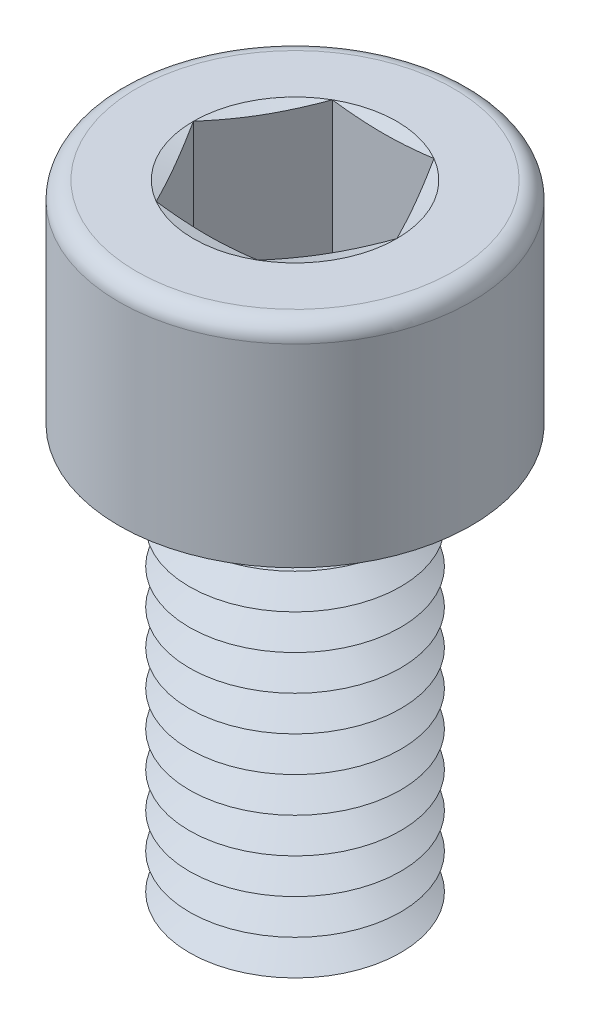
from build123d import *

# Parameters (mm, degrees)
SKETCH1_R       = 3
EXTRUDE1_DEPTH  = 12
SKETCH2_R       = 5
EXTRUDE2_DEPTH  = 6
EXTRUDE3_DEPTH  = 5
FILLET1_R       = 0.5
LPATTERN1_COUNT = 12
LPATTERN1_PITCH = 1


with BuildPart() as part:
    # Sketch1 → Extrude1 (new body)
    with BuildSketch(Plane(origin=(0, 0, 0), x_dir=(1, 0, 0), z_dir=(0, 1, 0))):
        with Locations(Location((0, 0, 0), (0, 0, 270))):
            Circle(SKETCH1_R)
    extrude(amount=EXTRUDE1_DEPTH)

    # Sketch2 → Extrude2 (add)
    with BuildSketch(Plane(origin=(0, 12, 0), x_dir=(1, 0, 0), z_dir=(0, 1, 0))):
        with Locations(Location((0, 0, 0), (0, 0, 270))):
            Circle(SKETCH2_R)
    extrude(amount=EXTRUDE2_DEPTH)

    # Sketch3 → Extrude3 (cut)
    with BuildSketch(Plane(origin=(0, 18, 0), x_dir=(1, 0, 0), z_dir=(0, 1, 0))):
        Polygon((1.443375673, 2.5), (-1.443375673, 2.5), (-2.886751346, 0), (-1.443375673, -2.5), (1.443375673, -2.5), (2.886751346, 0), align=None)
    extrude(amount=-EXTRUDE3_DEPTH, mode=Mode.SUBTRACT)

    # Fillet1
    fillet1_edges = [part.edges().sort_by_distance(p)[0] for p in [
        (0, 18, -5),
    ]]
    fillet(fillet1_edges, radius=FILLET1_R)

    # Sketch4 → Cut-Revolve1 (revolve, cut)
    with BuildSketch(Plane(origin=(0, 0, 0), x_dir=(0, 0, -1), z_dir=(1, 0, 0))):
        Polygon((-2.5, 13), (0, 13), (0, 11.556624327), align=None)
    revolve(axis=Axis((0, 13, 0), (0, -1, 0)), mode=Mode.SUBTRACT)

    # Sketch5 → Cut-Revolve2 (revolve, cut)
    with BuildSketch(Plane.XY, mode=Mode.PRIVATE) as cut_revolve2_sk:
        Polygon((-3, 0.5), (-3, -0.5), (-2.133974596, 0), align=None)
    cut_revolve2 = revolve(cut_revolve2_sk.sketch.rotate(Axis((0, 12, 0), (0, -1, 0)), 270), axis=Axis((0, 12, 0), (0, -1, 0)), mode=Mode.SUBTRACT)

    # LPattern1: Cut-Revolve2 ×12
    with Locations(*[(0, i * LPATTERN1_PITCH, 0) for i in range(1, LPATTERN1_COUNT)]):
        add(cut_revolve2, mode=Mode.SUBTRACT)

    # Extrude4 cone 1 section (on through the dimple's axis) → Extrude4 (revolve, cut)
    with BuildSketch(Plane(origin=(0, 18, 0), x_dir=(0, 0, 1), z_dir=(1, 0, 0))):
        Polygon((0, 0), (2.886751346, 0), (0, 0.773502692), align=None)
    revolve(axis=Axis((0, 18, 0), (0, -1, 0)), mode=Mode.SUBTRACT)


solid = part.part
